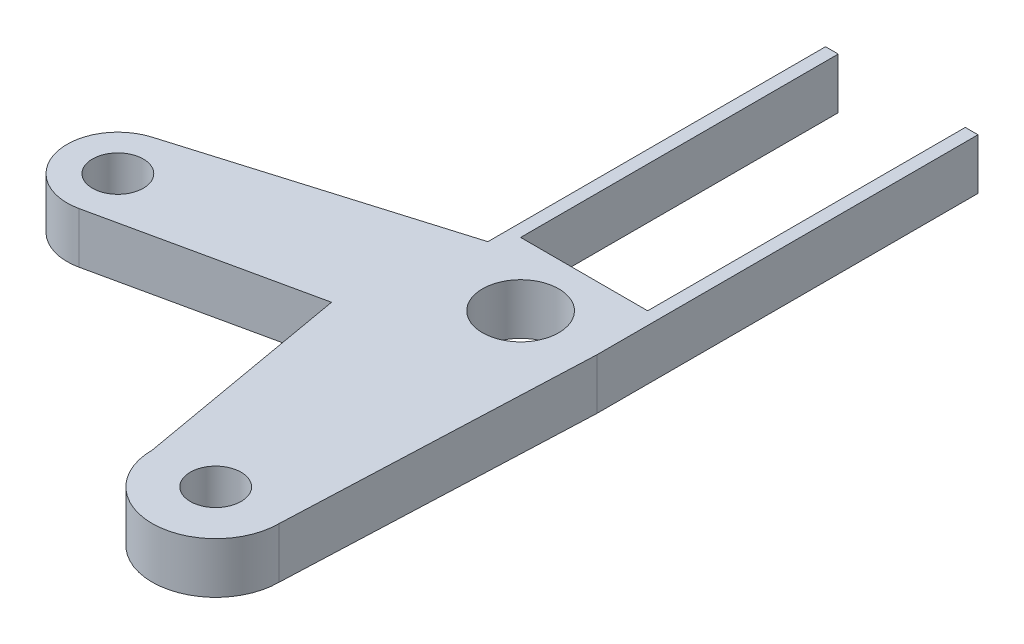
from build123d import *

# Parameters (mm, degrees)
SKIZZE2_R                       = 15
SKIZZE2_R_2                     = 10
AUFSATZ_LINEAR_AUSTRAGEN1_DEPTH = 20


with BuildPart() as part:
    # Skizze2 → Aufsatz-Linear austragen1 (new body)
    with BuildSketch(Plane(origin=(0, 360, 0), x_dir=(1, 0, 0), z_dir=(0, 1, 0))):
        with BuildLine():
            Line((-131.735689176, -353.340097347), (-30, -322.884603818))
            Line((-30, -322.884603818), (-30, -190))
            Line((-30, -190), (-25, -190))
            Line((-25, -190), (-25, -315))
            Line((-25, -315), (25, -315))
            Line((25, -315), (25, -190))
            Line((25, -190), (30, -190))
            Line((30, -190), (30, -340))
            Line((30, -340), (25, -460))
            ThreePointArc((25, -460), (0, -485), (-25, -460))
            Line((-25, -460), (-40.111076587, -374.300826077))
            Line((-40.111076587, -374.300826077), (-121.752595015, -392.04378548))
            ThreePointArc((-121.752595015, -392.04378548), (-145.366146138, -377.495236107), (-131.735689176, -353.340097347))
        make_face()
        with Locations(Location((0, -340, 0), (0, 0, 270))):
            Circle(SKIZZE2_R, mode=Mode.SUBTRACT)
        with Locations(Location((-126, -372.5, 0), (0, 0, 270))):
            Circle(SKIZZE2_R_2, mode=Mode.SUBTRACT)
        with Locations(Location((0, -460, 0), (0, 0, 270))):
            Circle(SKIZZE2_R_2, mode=Mode.SUBTRACT)
    extrude(amount=AUFSATZ_LINEAR_AUSTRAGEN1_DEPTH)


solid = part.part
